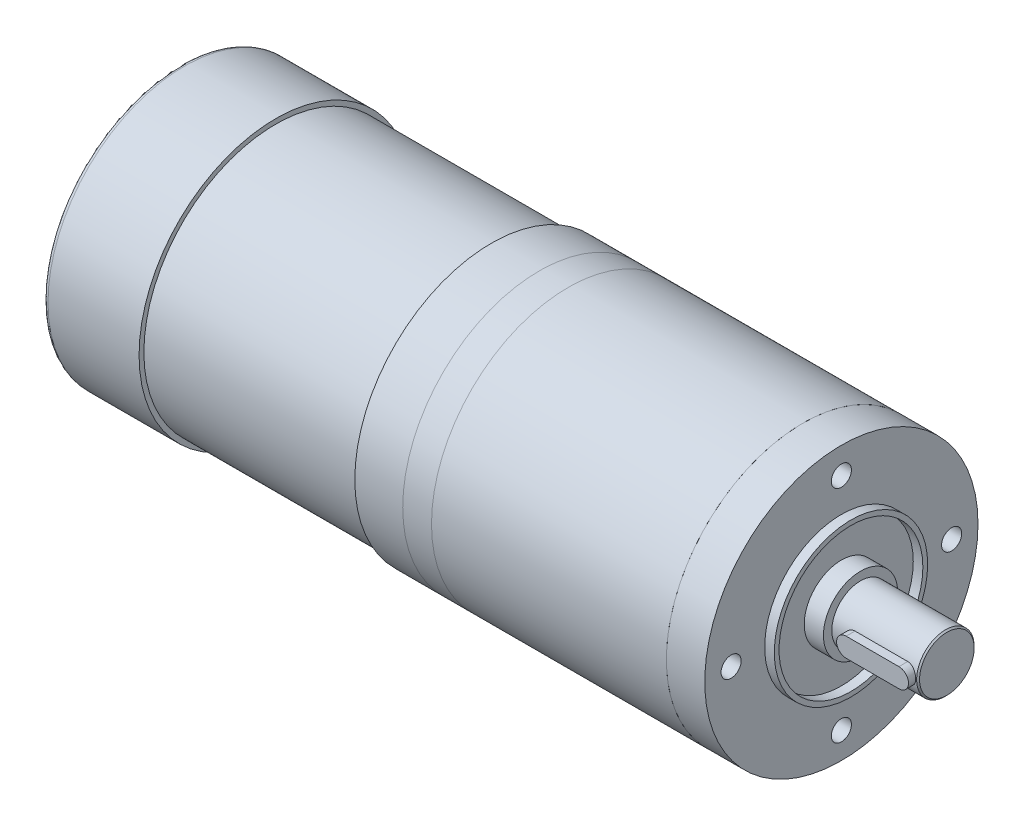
ISO-10303-21;
HEADER;
FILE_DESCRIPTION(('STEP AP214'),'2;1');
FILE_NAME('part.step','',(''),(''),'','','');
FILE_SCHEMA(('AUTOMOTIVE_DESIGN { 1 0 10303 214 1 1 1 1 }'));
ENDSEC;
DATA;
#1=APPLICATION_CONTEXT('core data for automotive mechanical design processes');
#2=APPLICATION_PROTOCOL_DEFINITION('international standard','automotive_design',2000,#1);
#3=PRODUCT_CONTEXT('',#1,'mechanical');
#4=PRODUCT('Part','Part','',(#3));
#5=PRODUCT_RELATED_PRODUCT_CATEGORY('part','',(#4));
#6=PRODUCT_DEFINITION_FORMATION('','',#4);
#7=PRODUCT_DEFINITION_CONTEXT('part definition',#1,'design');
#8=PRODUCT_DEFINITION('design','',#6,#7);
#9=PRODUCT_DEFINITION_SHAPE('','',#8);
#10=(LENGTH_UNIT() NAMED_UNIT(*) SI_UNIT(.MILLI.,.METRE.));
#11=(NAMED_UNIT(*) PLANE_ANGLE_UNIT() SI_UNIT($,.RADIAN.));
#12=(NAMED_UNIT(*) SI_UNIT($,.STERADIAN.) SOLID_ANGLE_UNIT());
#13=UNCERTAINTY_MEASURE_WITH_UNIT(LENGTH_MEASURE(1.E-05),#10,'distance_accuracy_value','');
#14=(GEOMETRIC_REPRESENTATION_CONTEXT(3) GLOBAL_UNCERTAINTY_ASSIGNED_CONTEXT((#13)) GLOBAL_UNIT_ASSIGNED_CONTEXT((#10,
#11,#12)) REPRESENTATION_CONTEXT('',''));
#15=CARTESIAN_POINT('',(0.,0.,0.));
#16=DIRECTION('',(0.,0.,1.));
#17=DIRECTION('',(1.,0.,0.));
#18=AXIS2_PLACEMENT_3D('',#15,#16,#17);
#19=CARTESIAN_POINT('',(8.5,0.,7.5));
#20=DIRECTION('',(0.,0.,-1.));
#21=DIRECTION('',(-1.,0.,0.));
#22=AXIS2_PLACEMENT_3D('',#19,#20,#21);
#23=CYLINDRICAL_SURFACE('',#22,2.);
#24=CARTESIAN_POINT('',(8.5,0.,3.5));
#25=DIRECTION('',(0.,0.,1.));
#26=DIRECTION('',(1.,0.,0.));
#27=AXIS2_PLACEMENT_3D('',#24,#25,#26);
#28=CIRCLE('',#27,2.);
#29=CARTESIAN_POINT('',(8.5,2.,3.5));
#30=VERTEX_POINT('',#29);
#31=CARTESIAN_POINT('',(8.5,-2.,3.5));
#32=VERTEX_POINT('',#31);
#33=EDGE_CURVE('E109',#30,#32,#28,.T.);
#34=ORIENTED_EDGE('',*,*,#33,.T.);
#35=DIRECTION('',(0.,0.,-1.));
#36=VECTOR('',#35,1.);
#37=CARTESIAN_POINT('',(8.5,-2.,7.5));
#38=LINE('',#37,#36);
#39=CARTESIAN_POINT('',(8.5,-2.,7.5));
#40=VERTEX_POINT('',#39);
#41=EDGE_CURVE('E12',#40,#32,#38,.T.);
#42=ORIENTED_EDGE('',*,*,#41,.F.);
#43=CARTESIAN_POINT('',(8.5,0.,7.5));
#44=DIRECTION('',(0.,0.,1.));
#45=DIRECTION('',(1.,0.,0.));
#46=AXIS2_PLACEMENT_3D('',#43,#44,#45);
#47=CIRCLE('',#46,2.);
#48=CARTESIAN_POINT('',(8.5,2.,7.5));
#49=VERTEX_POINT('',#48);
#50=EDGE_CURVE('E97',#49,#40,#47,.T.);
#51=ORIENTED_EDGE('',*,*,#50,.F.);
#52=DIRECTION('',(0.,0.,-1.));
#53=VECTOR('',#52,1.);
#54=CARTESIAN_POINT('',(8.5,2.,7.5));
#55=LINE('',#54,#53);
#56=EDGE_CURVE('E105',#49,#30,#55,.T.);
#57=ORIENTED_EDGE('',*,*,#56,.T.);
#58=EDGE_LOOP('',(#34,#42,#51,#57));
#59=FACE_BOUND('',#58,.T.);
#60=ADVANCED_FACE('F46',(#59),#23,.T.);
#61=CARTESIAN_POINT('',(19.5,-2.,7.5));
#62=DIRECTION('',(0.,1.,0.));
#63=DIRECTION('',(-1.,0.,0.));
#64=AXIS2_PLACEMENT_3D('',#61,#62,#63);
#65=PLANE('',#64);
#66=DIRECTION('',(1.,0.,0.));
#67=VECTOR('',#66,1.);
#68=CARTESIAN_POINT('',(19.5,-2.,3.5));
#69=LINE('',#68,#67);
#70=CARTESIAN_POINT('',(19.5,-2.,3.5));
#71=VERTEX_POINT('',#70);
#72=EDGE_CURVE('E101',#32,#71,#69,.T.);
#73=ORIENTED_EDGE('',*,*,#72,.T.);
#74=DIRECTION('',(0.,0.,-1.));
#75=VECTOR('',#74,1.);
#76=CARTESIAN_POINT('',(19.5,-2.,7.5));
#77=LINE('',#76,#75);
#78=CARTESIAN_POINT('',(19.5,-2.,7.5));
#79=VERTEX_POINT('',#78);
#80=EDGE_CURVE('E54',#79,#71,#77,.T.);
#81=ORIENTED_EDGE('',*,*,#80,.F.);
#82=DIRECTION('',(1.,0.,0.));
#83=VECTOR('',#82,1.);
#84=CARTESIAN_POINT('',(19.5,-2.,7.5));
#85=LINE('',#84,#83);
#86=EDGE_CURVE('E92',#40,#79,#85,.T.);
#87=ORIENTED_EDGE('',*,*,#86,.F.);
#88=ORIENTED_EDGE('',*,*,#41,.T.);
#89=EDGE_LOOP('',(#73,#81,#87,#88));
#90=FACE_BOUND('',#89,.T.);
#91=ADVANCED_FACE('F100',(#90),#65,.F.);
#92=CARTESIAN_POINT('',(19.5,0.,7.5));
#93=DIRECTION('',(0.,0.,-1.));
#94=DIRECTION('',(-1.,0.,0.));
#95=AXIS2_PLACEMENT_3D('',#92,#93,#94);
#96=CYLINDRICAL_SURFACE('',#95,2.);
#97=CARTESIAN_POINT('',(19.5,0.,3.5));
#98=DIRECTION('',(0.,0.,1.));
#99=DIRECTION('',(1.,0.,0.));
#100=AXIS2_PLACEMENT_3D('',#97,#98,#99);
#101=CIRCLE('',#100,2.);
#102=CARTESIAN_POINT('',(19.5,2.,3.5));
#103=VERTEX_POINT('',#102);
#104=EDGE_CURVE('E79',#71,#103,#101,.T.);
#105=ORIENTED_EDGE('',*,*,#104,.T.);
#106=DIRECTION('',(0.,0.,-1.));
#107=VECTOR('',#106,1.);
#108=CARTESIAN_POINT('',(19.5,2.,7.5));
#109=LINE('',#108,#107);
#110=CARTESIAN_POINT('',(19.5,2.,7.5));
#111=VERTEX_POINT('',#110);
#112=EDGE_CURVE('E102',#111,#103,#109,.T.);
#113=ORIENTED_EDGE('',*,*,#112,.F.);
#114=CARTESIAN_POINT('',(19.5,0.,7.5));
#115=DIRECTION('',(0.,0.,1.));
#116=DIRECTION('',(1.,0.,0.));
#117=AXIS2_PLACEMENT_3D('',#114,#115,#116);
#118=CIRCLE('',#117,2.);
#119=EDGE_CURVE('E95',#79,#111,#118,.T.);
#120=ORIENTED_EDGE('',*,*,#119,.F.);
#121=ORIENTED_EDGE('',*,*,#80,.T.);
#122=EDGE_LOOP('',(#105,#113,#120,#121));
#123=FACE_BOUND('',#122,.T.);
#124=ADVANCED_FACE('F103',(#123),#96,.T.);
#125=CARTESIAN_POINT('',(8.5,2.,7.5));
#126=DIRECTION('',(0.,-1.,0.));
#127=DIRECTION('',(1.,0.,0.));
#128=AXIS2_PLACEMENT_3D('',#125,#126,#127);
#129=PLANE('',#128);
#130=DIRECTION('',(-1.,0.,0.));
#131=VECTOR('',#130,1.);
#132=CARTESIAN_POINT('',(8.5,2.,3.5));
#133=LINE('',#132,#131);
#134=EDGE_CURVE('E85',#103,#30,#133,.T.);
#135=ORIENTED_EDGE('',*,*,#134,.T.);
#136=ORIENTED_EDGE('',*,*,#56,.F.);
#137=DIRECTION('',(-1.,0.,0.));
#138=VECTOR('',#137,1.);
#139=CARTESIAN_POINT('',(8.5,2.,7.5));
#140=LINE('',#139,#138);
#141=EDGE_CURVE('E62',#111,#49,#140,.T.);
#142=ORIENTED_EDGE('',*,*,#141,.F.);
#143=ORIENTED_EDGE('',*,*,#112,.T.);
#144=EDGE_LOOP('',(#135,#136,#142,#143));
#145=FACE_BOUND('',#144,.T.);
#146=ADVANCED_FACE('F116',(#145),#129,.F.);
#147=CARTESIAN_POINT('',(8.5,0.,7.5));
#148=DIRECTION('',(0.,0.,1.));
#149=DIRECTION('',(1.,0.,0.));
#150=AXIS2_PLACEMENT_3D('',#147,#148,#149);
#151=PLANE('',#150);
#152=ORIENTED_EDGE('',*,*,#50,.T.);
#153=ORIENTED_EDGE('',*,*,#86,.T.);
#154=ORIENTED_EDGE('',*,*,#119,.T.);
#155=ORIENTED_EDGE('',*,*,#141,.T.);
#156=EDGE_LOOP('',(#152,#153,#154,#155));
#157=FACE_BOUND('',#156,.T.);
#158=ADVANCED_FACE('F93',(#157),#151,.T.);
#159=CARTESIAN_POINT('',(8.5,0.,3.5));
#160=DIRECTION('',(0.,0.,1.));
#161=DIRECTION('',(1.,0.,0.));
#162=AXIS2_PLACEMENT_3D('',#159,#160,#161);
#163=PLANE('',#162);
#164=ORIENTED_EDGE('',*,*,#33,.F.);
#165=ORIENTED_EDGE('',*,*,#134,.F.);
#166=ORIENTED_EDGE('',*,*,#104,.F.);
#167=ORIENTED_EDGE('',*,*,#72,.F.);
#168=EDGE_LOOP('',(#164,#165,#166,#167));
#169=FACE_BOUND('',#168,.T.);
#170=ADVANCED_FACE('F119',(#169),#163,.F.);
#171=CLOSED_SHELL('',(#60,#91,#124,#146,#158,#170));
#172=MANIFOLD_SOLID_BREP('B2',#171);
#173=CARTESIAN_POINT('',(-73.,0.,0.));
#174=DIRECTION('',(-1.,0.,0.));
#175=DIRECTION('',(0.,0.,1.));
#176=AXIS2_PLACEMENT_3D('',#173,#174,#175);
#177=PLANE('',#176);
#178=CARTESIAN_POINT('',(-73.,0.,0.));
#179=DIRECTION('',(-1.,0.,0.));
#180=DIRECTION('',(0.,0.,1.));
#181=AXIS2_PLACEMENT_3D('',#178,#179,#180);
#182=CIRCLE('',#181,28.5);
#183=CARTESIAN_POINT('',(-73.,0.,28.5));
#184=VERTEX_POINT('',#183);
#185=EDGE_CURVE('E189',#184,#184,#182,.T.);
#186=ORIENTED_EDGE('',*,*,#185,.T.);
#187=EDGE_LOOP('',(#186));
#188=FACE_BOUND('',#187,.T.);
#189=CARTESIAN_POINT('',(-73.,0.,0.));
#190=DIRECTION('',(-1.,0.,0.));
#191=DIRECTION('',(0.,0.,1.));
#192=AXIS2_PLACEMENT_3D('',#189,#190,#191);
#193=CIRCLE('',#192,27.5);
#194=CARTESIAN_POINT('',(-73.,0.,-27.5));
#195=VERTEX_POINT('',#194);
#196=EDGE_CURVE('E199',#195,#195,#193,.T.);
#197=ORIENTED_EDGE('',*,*,#196,.F.);
#198=EDGE_LOOP('',(#197));
#199=FACE_BOUND('',#198,.T.);
#200=ADVANCED_FACE('F178',(#188,#199),#177,.T.);
#201=CARTESIAN_POINT('',(-73.,0.,0.));
#202=DIRECTION('',(1.,0.,0.));
#203=DIRECTION('',(0.,0.,-1.));
#204=AXIS2_PLACEMENT_3D('',#201,#202,#203);
#205=CYLINDRICAL_SURFACE('',#204,28.5);
#206=ORIENTED_EDGE('',*,*,#185,.F.);
#207=EDGE_LOOP('',(#206));
#208=FACE_BOUND('',#207,.T.);
#209=CARTESIAN_POINT('',(-63.,0.,0.));
#210=DIRECTION('',(-1.,0.,0.));
#211=DIRECTION('',(0.,0.,1.));
#212=AXIS2_PLACEMENT_3D('',#209,#210,#211);
#213=CIRCLE('',#212,28.5);
#214=CARTESIAN_POINT('',(-63.,0.,28.5));
#215=VERTEX_POINT('',#214);
#216=EDGE_CURVE('E193',#215,#215,#213,.T.);
#217=ORIENTED_EDGE('',*,*,#216,.T.);
#218=EDGE_LOOP('',(#217));
#219=FACE_BOUND('',#218,.T.);
#220=ADVANCED_FACE('F224',(#208,#219),#205,.T.);
#221=CARTESIAN_POINT('',(-63.,0.,0.));
#222=DIRECTION('',(-1.,0.,0.));
#223=DIRECTION('',(0.,0.,1.));
#224=AXIS2_PLACEMENT_3D('',#221,#222,#223);
#225=PLANE('',#224);
#226=ORIENTED_EDGE('',*,*,#216,.F.);
#227=EDGE_LOOP('',(#226));
#228=FACE_BOUND('',#227,.T.);
#229=ADVANCED_FACE('F219',(#228),#225,.F.);
#230=CARTESIAN_POINT('',(-118.,0.,0.));
#231=DIRECTION('',(1.,0.,0.));
#232=DIRECTION('',(0.,0.,-1.));
#233=AXIS2_PLACEMENT_3D('',#230,#231,#232);
#234=CYLINDRICAL_SURFACE('',#233,27.5);
#235=CARTESIAN_POINT('',(-118.,0.,0.));
#236=DIRECTION('',(-1.,0.,0.));
#237=DIRECTION('',(0.,0.,1.));
#238=AXIS2_PLACEMENT_3D('',#235,#236,#237);
#239=CIRCLE('',#238,27.5);
#240=CARTESIAN_POINT('',(-118.,0.,-27.5));
#241=VERTEX_POINT('',#240);
#242=EDGE_CURVE('E197',#241,#241,#239,.T.);
#243=CARTESIAN_POINT('',(-118.,0.,-27.5));
#244=CARTESIAN_POINT('',(-117.53125,0.,-27.5));
#245=CARTESIAN_POINT('',(-117.0625,0.,-27.5));
#246=CARTESIAN_POINT('',(-116.125,0.,-27.5));
#247=CARTESIAN_POINT('',(-115.65625,0.,-27.5));
#248=CARTESIAN_POINT('',(-114.71875,0.,-27.5));
#249=CARTESIAN_POINT('',(-114.25,0.,-27.5));
#250=CARTESIAN_POINT('',(-113.3125,0.,-27.5));
#251=CARTESIAN_POINT('',(-112.84375,0.,-27.5));
#252=CARTESIAN_POINT('',(-111.90625,0.,-27.5));
#253=CARTESIAN_POINT('',(-111.4375,0.,-27.5));
#254=CARTESIAN_POINT('',(-110.5,0.,-27.5));
#255=CARTESIAN_POINT('',(-110.03125,0.,-27.5));
#256=CARTESIAN_POINT('',(-109.09375,0.,-27.5));
#257=CARTESIAN_POINT('',(-108.625,0.,-27.5));
#258=CARTESIAN_POINT('',(-107.6875,0.,-27.5));
#259=CARTESIAN_POINT('',(-107.21875,0.,-27.5));
#260=CARTESIAN_POINT('',(-106.28125,0.,-27.5));
#261=CARTESIAN_POINT('',(-105.8125,0.,-27.5));
#262=CARTESIAN_POINT('',(-104.875,0.,-27.5));
#263=CARTESIAN_POINT('',(-104.40625,0.,-27.5));
#264=CARTESIAN_POINT('',(-103.46875,0.,-27.5));
#265=CARTESIAN_POINT('',(-103.,0.,-27.5));
#266=CARTESIAN_POINT('',(-102.0625,0.,-27.5));
#267=CARTESIAN_POINT('',(-101.59375,0.,-27.5));
#268=CARTESIAN_POINT('',(-100.65625,0.,-27.5));
#269=CARTESIAN_POINT('',(-100.1875,0.,-27.5));
#270=CARTESIAN_POINT('',(-99.25,0.,-27.5));
#271=CARTESIAN_POINT('',(-98.78125,0.,-27.5));
#272=CARTESIAN_POINT('',(-97.84375,0.,-27.5));
#273=CARTESIAN_POINT('',(-97.375,0.,-27.5));
#274=CARTESIAN_POINT('',(-96.4375,0.,-27.5));
#275=CARTESIAN_POINT('',(-95.96875,0.,-27.5));
#276=CARTESIAN_POINT('',(-95.03125,0.,-27.5));
#277=CARTESIAN_POINT('',(-94.5625,0.,-27.5));
#278=CARTESIAN_POINT('',(-93.625,0.,-27.5));
#279=CARTESIAN_POINT('',(-93.15625,0.,-27.5));
#280=CARTESIAN_POINT('',(-92.21875,0.,-27.5));
#281=CARTESIAN_POINT('',(-91.75,0.,-27.5));
#282=CARTESIAN_POINT('',(-90.8125,0.,-27.5));
#283=CARTESIAN_POINT('',(-90.34375,0.,-27.5));
#284=CARTESIAN_POINT('',(-89.40625,0.,-27.5));
#285=CARTESIAN_POINT('',(-88.9375,0.,-27.5));
#286=CARTESIAN_POINT('',(-88.,0.,-27.5));
#287=CARTESIAN_POINT('',(-87.53125,0.,-27.5));
#288=CARTESIAN_POINT('',(-86.59375,0.,-27.5));
#289=CARTESIAN_POINT('',(-86.125,0.,-27.5));
#290=CARTESIAN_POINT('',(-85.1875,0.,-27.5));
#291=CARTESIAN_POINT('',(-84.71875,0.,-27.5));
#292=CARTESIAN_POINT('',(-83.78125,0.,-27.5));
#293=CARTESIAN_POINT('',(-83.3125,0.,-27.5));
#294=CARTESIAN_POINT('',(-82.375,0.,-27.5));
#295=CARTESIAN_POINT('',(-81.90625,0.,-27.5));
#296=CARTESIAN_POINT('',(-80.96875,0.,-27.5));
#297=CARTESIAN_POINT('',(-80.5,0.,-27.5));
#298=CARTESIAN_POINT('',(-79.5625,0.,-27.5));
#299=CARTESIAN_POINT('',(-79.09375,0.,-27.5));
#300=CARTESIAN_POINT('',(-78.15625,0.,-27.5));
#301=CARTESIAN_POINT('',(-77.6875,0.,-27.5));
#302=CARTESIAN_POINT('',(-76.75,0.,-27.5));
#303=CARTESIAN_POINT('',(-76.28125,0.,-27.5));
#304=CARTESIAN_POINT('',(-75.34375,0.,-27.5));
#305=CARTESIAN_POINT('',(-74.875,0.,-27.5));
#306=CARTESIAN_POINT('',(-73.9375,0.,-27.5));
#307=CARTESIAN_POINT('',(-73.46875,0.,-27.5));
#308=CARTESIAN_POINT('',(-73.,0.,-27.5));
#309=B_SPLINE_CURVE_WITH_KNOTS('',3,(#243,#244,#245,#246,#247,#248,#249,#250,#251,#252,#253,
#254,#255,#256,#257,#258,#259,#260,#261,#262,#263,#264,#265,#266,#267,#268,#269,#270,#271,#272,
#273,#274,#275,#276,#277,#278,#279,#280,#281,#282,#283,#284,#285,#286,#287,#288,#289,#290,#291,
#292,#293,#294,#295,#296,#297,#298,#299,#300,#301,#302,#303,#304,#305,#306,#307,#308),
.UNSPECIFIED.,.F.,.F.,(4,2,2,2,2,2,2,2,2,2,2,2,2,2,2,2,2,2,2,2,2,2,2,2,2,2,2,2,2,2,2,2,4),(0.,
1.40625,2.8125,4.21874999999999,5.62499999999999,7.03124999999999,8.43749999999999,9.84375,
11.25,12.65625,14.0625,15.46875,16.875,18.28125,19.6875,21.09375,22.5,23.90625,25.3125,26.71875,
28.125,29.53125,30.9375,32.34375,33.75,35.15625,36.5625,37.96875,39.375,40.78125,42.1875,
43.59375,45.),.UNSPECIFIED.);
#310=EDGE_CURVE('BSEAM213',#241,#195,#309,.T.);
#311=ORIENTED_EDGE('',*,*,#242,.F.);
#312=ORIENTED_EDGE('',*,*,#196,.T.);
#313=ORIENTED_EDGE('',*,*,#310,.T.);
#314=ORIENTED_EDGE('',*,*,#310,.F.);
#315=EDGE_LOOP('',(#311,#313,#312,#314));
#316=FACE_BOUND('',#315,.T.);
#317=ADVANCED_FACE('F213',(#316),#234,.T.);
#318=CARTESIAN_POINT('',(-118.,0.,0.));
#319=DIRECTION('',(-1.,0.,0.));
#320=DIRECTION('',(0.,0.,1.));
#321=AXIS2_PLACEMENT_3D('',#318,#319,#320);
#322=PLANE('',#321);
#323=CARTESIAN_POINT('',(-118.,0.,0.));
#324=DIRECTION('',(-1.,0.,0.));
#325=DIRECTION('',(0.,0.,1.));
#326=AXIS2_PLACEMENT_3D('',#323,#324,#325);
#327=CIRCLE('',#326,28.5);
#328=CARTESIAN_POINT('',(-118.,0.,28.5));
#329=VERTEX_POINT('',#328);
#330=EDGE_CURVE('E202',#329,#329,#327,.T.);
#331=ORIENTED_EDGE('',*,*,#330,.F.);
#332=EDGE_LOOP('',(#331));
#333=FACE_BOUND('',#332,.T.);
#334=ORIENTED_EDGE('',*,*,#242,.T.);
#335=EDGE_LOOP('',(#334));
#336=FACE_BOUND('',#335,.T.);
#337=ADVANCED_FACE('F210',(#333,#336),#322,.F.);
#338=CARTESIAN_POINT('',(-138.,0.,0.));
#339=DIRECTION('',(1.,0.,0.));
#340=DIRECTION('',(0.,0.,-1.));
#341=AXIS2_PLACEMENT_3D('',#338,#339,#340);
#342=CYLINDRICAL_SURFACE('',#341,28.5);
#343=CARTESIAN_POINT('',(-137.,0.,0.));
#344=DIRECTION('',(-1.,0.,0.));
#345=DIRECTION('',(0.,0.,1.));
#346=AXIS2_PLACEMENT_3D('',#343,#344,#345);
#347=CIRCLE('',#346,28.5);
#348=CARTESIAN_POINT('',(-137.,0.,28.5));
#349=VERTEX_POINT('',#348);
#350=EDGE_CURVE('E45',#349,#349,#347,.F.);
#351=ORIENTED_EDGE('',*,*,#350,.T.);
#352=EDGE_LOOP('',(#351));
#353=FACE_BOUND('',#352,.T.);
#354=ORIENTED_EDGE('',*,*,#330,.T.);
#355=EDGE_LOOP('',(#354));
#356=FACE_BOUND('',#355,.T.);
#357=ADVANCED_FACE('F208',(#353,#356),#342,.T.);
#358=CARTESIAN_POINT('',(-138.,0.,0.));
#359=DIRECTION('',(-1.,0.,0.));
#360=DIRECTION('',(0.,0.,1.));
#361=AXIS2_PLACEMENT_3D('',#358,#359,#360);
#362=PLANE('',#361);
#363=CARTESIAN_POINT('',(-138.,0.,0.));
#364=DIRECTION('',(-1.,0.,0.));
#365=DIRECTION('',(0.,0.,1.));
#366=AXIS2_PLACEMENT_3D('',#363,#364,#365);
#367=CIRCLE('',#366,27.5);
#368=CARTESIAN_POINT('',(-138.,0.,27.5));
#369=VERTEX_POINT('',#368);
#370=EDGE_CURVE('E185',#369,#369,#367,.T.);
#371=ORIENTED_EDGE('',*,*,#370,.T.);
#372=EDGE_LOOP('',(#371));
#373=FACE_BOUND('',#372,.T.);
#374=ADVANCED_FACE('F255',(#373),#362,.T.);
#375=CARTESIAN_POINT('',(-137.,0.,0.));
#376=DIRECTION('',(-1.,0.,0.));
#377=DIRECTION('',(0.,0.,1.));
#378=AXIS2_PLACEMENT_3D('',#375,#376,#377);
#379=TOROIDAL_SURFACE('',#378,27.5,1.);
#380=ORIENTED_EDGE('',*,*,#350,.F.);
#381=EDGE_LOOP('',(#380));
#382=FACE_BOUND('',#381,.T.);
#383=ORIENTED_EDGE('',*,*,#370,.F.);
#384=EDGE_LOOP('',(#383));
#385=FACE_BOUND('',#384,.T.);
#386=ADVANCED_FACE('F180',(#382,#385),#379,.T.);
#387=CLOSED_SHELL('',(#200,#220,#229,#317,#337,#357,#374,#386));
#388=MANIFOLD_SOLID_BREP('B6',#387);
#389=CARTESIAN_POINT('',(-63.,0.,0.));
#390=DIRECTION('',(1.,0.,0.));
#391=DIRECTION('',(0.,0.,-1.));
#392=AXIS2_PLACEMENT_3D('',#389,#390,#391);
#393=CYLINDRICAL_SURFACE('',#392,28.5);
#394=CARTESIAN_POINT('',(-63.,0.,0.));
#395=DIRECTION('',(-1.,0.,0.));
#396=DIRECTION('',(0.,0.,1.));
#397=AXIS2_PLACEMENT_3D('',#394,#395,#396);
#398=CIRCLE('',#397,28.5);
#399=CARTESIAN_POINT('',(-63.,0.,28.5));
#400=VERTEX_POINT('',#399);
#401=EDGE_CURVE('E177',#400,#400,#398,.T.);
#402=ORIENTED_EDGE('',*,*,#401,.F.);
#403=EDGE_LOOP('',(#402));
#404=FACE_BOUND('',#403,.T.);
#405=CARTESIAN_POINT('',(-57.,0.,0.));
#406=DIRECTION('',(-1.,0.,0.));
#407=DIRECTION('',(0.,0.,1.));
#408=AXIS2_PLACEMENT_3D('',#405,#406,#407);
#409=CIRCLE('',#408,28.5);
#410=CARTESIAN_POINT('',(-57.,0.,28.5));
#411=VERTEX_POINT('',#410);
#412=EDGE_CURVE('E307',#411,#411,#409,.T.);
#413=ORIENTED_EDGE('',*,*,#412,.T.);
#414=EDGE_LOOP('',(#413));
#415=FACE_BOUND('',#414,.T.);
#416=ADVANCED_FACE('F304',(#404,#415),#393,.T.);
#417=CARTESIAN_POINT('',(-63.,0.,0.));
#418=DIRECTION('',(-1.,0.,0.));
#419=DIRECTION('',(0.,0.,1.));
#420=AXIS2_PLACEMENT_3D('',#417,#418,#419);
#421=PLANE('',#420);
#422=ORIENTED_EDGE('',*,*,#401,.T.);
#423=EDGE_LOOP('',(#422));
#424=FACE_BOUND('',#423,.T.);
#425=ADVANCED_FACE('F319',(#424),#421,.T.);
#426=CARTESIAN_POINT('',(-57.,0.,0.));
#427=DIRECTION('',(-1.,0.,0.));
#428=DIRECTION('',(0.,0.,1.));
#429=AXIS2_PLACEMENT_3D('',#426,#427,#428);
#430=PLANE('',#429);
#431=ORIENTED_EDGE('',*,*,#412,.F.);
#432=EDGE_LOOP('',(#431));
#433=FACE_BOUND('',#432,.T.);
#434=ADVANCED_FACE('F317',(#433),#430,.F.);
#435=CLOSED_SHELL('',(#416,#425,#434));
#436=MANIFOLD_SOLID_BREP('B40',#435);
#437=CARTESIAN_POINT('',(-57.,0.,0.));
#438=DIRECTION('',(1.,0.,0.));
#439=DIRECTION('',(0.,0.,-1.));
#440=AXIS2_PLACEMENT_3D('',#437,#438,#439);
#441=CYLINDRICAL_SURFACE('',#440,28.5);
#442=CARTESIAN_POINT('',(-57.,0.,0.));
#443=DIRECTION('',(-1.,0.,0.));
#444=DIRECTION('',(0.,0.,1.));
#445=AXIS2_PLACEMENT_3D('',#442,#443,#444);
#446=CIRCLE('',#445,28.5);
#447=CARTESIAN_POINT('',(-57.,0.,28.5));
#448=VERTEX_POINT('',#447);
#449=EDGE_CURVE('E302',#448,#448,#446,.T.);
#450=ORIENTED_EDGE('',*,*,#449,.F.);
#451=EDGE_LOOP('',(#450));
#452=FACE_BOUND('',#451,.T.);
#453=CARTESIAN_POINT('',(-8.,0.,0.));
#454=DIRECTION('',(-1.,0.,0.));
#455=DIRECTION('',(0.,0.,1.));
#456=AXIS2_PLACEMENT_3D('',#453,#454,#455);
#457=CIRCLE('',#456,28.5);
#458=CARTESIAN_POINT('',(-8.,0.,28.5));
#459=VERTEX_POINT('',#458);
#460=EDGE_CURVE('E362',#459,#459,#457,.T.);
#461=ORIENTED_EDGE('',*,*,#460,.T.);
#462=EDGE_LOOP('',(#461));
#463=FACE_BOUND('',#462,.T.);
#464=ADVANCED_FACE('F354',(#452,#463),#441,.T.);
#465=CARTESIAN_POINT('',(-57.,0.,0.));
#466=DIRECTION('',(-1.,0.,0.));
#467=DIRECTION('',(0.,0.,1.));
#468=AXIS2_PLACEMENT_3D('',#465,#466,#467);
#469=PLANE('',#468);
#470=ORIENTED_EDGE('',*,*,#449,.T.);
#471=EDGE_LOOP('',(#470));
#472=FACE_BOUND('',#471,.T.);
#473=ADVANCED_FACE('F427',(#472),#469,.T.);
#474=CARTESIAN_POINT('',(-8.,0.,0.));
#475=DIRECTION('',(-1.,0.,0.));
#476=DIRECTION('',(0.,0.,1.));
#477=AXIS2_PLACEMENT_3D('',#474,#475,#476);
#478=PLANE('',#477);
#479=CARTESIAN_POINT('',(-8.,23.,0.));
#480=DIRECTION('',(-1.,0.,0.));
#481=DIRECTION('',(0.,0.,1.));
#482=AXIS2_PLACEMENT_3D('',#479,#480,#481);
#483=CIRCLE('',#482,2.1);
#484=CARTESIAN_POINT('',(-8.,23.,2.1));
#485=VERTEX_POINT('',#484);
#486=EDGE_CURVE('E357',#485,#485,#483,.T.);
#487=ORIENTED_EDGE('',*,*,#486,.T.);
#488=EDGE_LOOP('',(#487));
#489=FACE_BOUND('',#488,.T.);
#490=CARTESIAN_POINT('',(-8.,0.,-23.));
#491=DIRECTION('',(-1.,0.,0.));
#492=DIRECTION('',(0.,0.,1.));
#493=AXIS2_PLACEMENT_3D('',#490,#491,#492);
#494=CIRCLE('',#493,2.1);
#495=CARTESIAN_POINT('',(-8.,0.,-20.9));
#496=VERTEX_POINT('',#495);
#497=EDGE_CURVE('E391',#496,#496,#494,.T.);
#498=ORIENTED_EDGE('',*,*,#497,.T.);
#499=EDGE_LOOP('',(#498));
#500=FACE_BOUND('',#499,.T.);
#501=CARTESIAN_POINT('',(-8.,-23.,0.));
#502=DIRECTION('',(-1.,0.,0.));
#503=DIRECTION('',(0.,0.,1.));
#504=AXIS2_PLACEMENT_3D('',#501,#502,#503);
#505=CIRCLE('',#504,2.1);
#506=CARTESIAN_POINT('',(-8.,-23.,2.1));
#507=VERTEX_POINT('',#506);
#508=EDGE_CURVE('E395',#507,#507,#505,.T.);
#509=ORIENTED_EDGE('',*,*,#508,.T.);
#510=EDGE_LOOP('',(#509));
#511=FACE_BOUND('',#510,.T.);
#512=CARTESIAN_POINT('',(-8.,0.,23.));
#513=DIRECTION('',(-1.,0.,0.));
#514=DIRECTION('',(0.,0.,1.));
#515=AXIS2_PLACEMENT_3D('',#512,#513,#514);
#516=CIRCLE('',#515,2.1);
#517=CARTESIAN_POINT('',(-8.,0.,25.1));
#518=VERTEX_POINT('',#517);
#519=EDGE_CURVE('E398',#518,#518,#516,.T.);
#520=ORIENTED_EDGE('',*,*,#519,.T.);
#521=EDGE_LOOP('',(#520));
#522=FACE_BOUND('',#521,.T.);
#523=ORIENTED_EDGE('',*,*,#460,.F.);
#524=EDGE_LOOP('',(#523));
#525=FACE_BOUND('',#524,.T.);
#526=ADVANCED_FACE('F408',(#489,#500,#511,#522,#525),#478,.F.);
#527=CARTESIAN_POINT('',(0.,0.,23.));
#528=DIRECTION('',(1.,0.,0.));
#529=DIRECTION('',(0.,0.,-1.));
#530=AXIS2_PLACEMENT_3D('',#527,#528,#529);
#531=CYLINDRICAL_SURFACE('',#530,2.1);
#532=CARTESIAN_POINT('',(-14.,0.,23.));
#533=DIRECTION('',(1.,0.,0.));
#534=DIRECTION('',(0.,0.,-1.));
#535=AXIS2_PLACEMENT_3D('',#532,#533,#534);
#536=CIRCLE('',#535,2.1);
#537=CARTESIAN_POINT('',(-14.,0.,20.9));
#538=VERTEX_POINT('',#537);
#539=EDGE_CURVE('E396',#538,#538,#536,.T.);
#540=ORIENTED_EDGE('',*,*,#539,.F.);
#541=EDGE_LOOP('',(#540));
#542=FACE_BOUND('',#541,.T.);
#543=ORIENTED_EDGE('',*,*,#519,.F.);
#544=EDGE_LOOP('',(#543));
#545=FACE_BOUND('',#544,.T.);
#546=ADVANCED_FACE('F439',(#542,#545),#531,.F.);
#547=CARTESIAN_POINT('',(-14.,0.,23.));
#548=DIRECTION('',(1.,0.,0.));
#549=DIRECTION('',(0.,0.,-1.));
#550=AXIS2_PLACEMENT_3D('',#547,#548,#549);
#551=CONICAL_SURFACE('',#550,2.1,1.02974425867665);
#552=CARTESIAN_POINT('',(-15.2618072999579,0.,23.));
#553=VERTEX_POINT('',#552);
#554=VERTEX_LOOP('',#553);
#555=FACE_BOUND('',#554,.T.);
#556=ORIENTED_EDGE('',*,*,#539,.T.);
#557=EDGE_LOOP('',(#556));
#558=FACE_BOUND('',#557,.T.);
#559=ADVANCED_FACE('F444',(#555,#558),#551,.F.);
#560=CARTESIAN_POINT('',(0.,-23.,0.));
#561=DIRECTION('',(1.,0.,0.));
#562=DIRECTION('',(0.,0.,-1.));
#563=AXIS2_PLACEMENT_3D('',#560,#561,#562);
#564=CYLINDRICAL_SURFACE('',#563,2.1);
#565=CARTESIAN_POINT('',(-14.,-23.,0.));
#566=DIRECTION('',(1.,0.,0.));
#567=DIRECTION('',(0.,0.,-1.));
#568=AXIS2_PLACEMENT_3D('',#565,#566,#567);
#569=CIRCLE('',#568,2.1);
#570=CARTESIAN_POINT('',(-14.,-23.,-2.1));
#571=VERTEX_POINT('',#570);
#572=EDGE_CURVE('E392',#571,#571,#569,.T.);
#573=ORIENTED_EDGE('',*,*,#572,.F.);
#574=EDGE_LOOP('',(#573));
#575=FACE_BOUND('',#574,.T.);
#576=ORIENTED_EDGE('',*,*,#508,.F.);
#577=EDGE_LOOP('',(#576));
#578=FACE_BOUND('',#577,.T.);
#579=ADVANCED_FACE('F423',(#575,#578),#564,.F.);
#580=CARTESIAN_POINT('',(-14.,-23.,0.));
#581=DIRECTION('',(1.,0.,0.));
#582=DIRECTION('',(0.,0.,-1.));
#583=AXIS2_PLACEMENT_3D('',#580,#581,#582);
#584=CONICAL_SURFACE('',#583,2.1,1.02974425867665);
#585=CARTESIAN_POINT('',(-15.2618072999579,-23.,0.));
#586=VERTEX_POINT('',#585);
#587=VERTEX_LOOP('',#586);
#588=FACE_BOUND('',#587,.T.);
#589=ORIENTED_EDGE('',*,*,#572,.T.);
#590=EDGE_LOOP('',(#589));
#591=FACE_BOUND('',#590,.T.);
#592=ADVANCED_FACE('F414',(#588,#591),#584,.F.);
#593=CARTESIAN_POINT('',(0.,0.,-23.));
#594=DIRECTION('',(1.,0.,0.));
#595=DIRECTION('',(0.,0.,-1.));
#596=AXIS2_PLACEMENT_3D('',#593,#594,#595);
#597=CYLINDRICAL_SURFACE('',#596,2.1);
#598=CARTESIAN_POINT('',(-14.,0.,-23.));
#599=DIRECTION('',(1.,0.,0.));
#600=DIRECTION('',(0.,0.,-1.));
#601=AXIS2_PLACEMENT_3D('',#598,#599,#600);
#602=CIRCLE('',#601,2.1);
#603=CARTESIAN_POINT('',(-14.,0.,-25.1));
#604=VERTEX_POINT('',#603);
#605=EDGE_CURVE('E387',#604,#604,#602,.T.);
#606=ORIENTED_EDGE('',*,*,#605,.F.);
#607=EDGE_LOOP('',(#606));
#608=FACE_BOUND('',#607,.T.);
#609=ORIENTED_EDGE('',*,*,#497,.F.);
#610=EDGE_LOOP('',(#609));
#611=FACE_BOUND('',#610,.T.);
#612=ADVANCED_FACE('F411',(#608,#611),#597,.F.);
#613=CARTESIAN_POINT('',(-14.,0.,-23.));
#614=DIRECTION('',(1.,0.,0.));
#615=DIRECTION('',(0.,0.,-1.));
#616=AXIS2_PLACEMENT_3D('',#613,#614,#615);
#617=CONICAL_SURFACE('',#616,2.1,1.02974425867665);
#618=CARTESIAN_POINT('',(-15.2618072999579,0.,-23.));
#619=VERTEX_POINT('',#618);
#620=VERTEX_LOOP('',#619);
#621=FACE_BOUND('',#620,.T.);
#622=ORIENTED_EDGE('',*,*,#605,.T.);
#623=EDGE_LOOP('',(#622));
#624=FACE_BOUND('',#623,.T.);
#625=ADVANCED_FACE('F413',(#621,#624),#617,.F.);
#626=CARTESIAN_POINT('',(0.,23.,0.));
#627=DIRECTION('',(1.,0.,0.));
#628=DIRECTION('',(0.,0.,-1.));
#629=AXIS2_PLACEMENT_3D('',#626,#627,#628);
#630=CYLINDRICAL_SURFACE('',#629,2.1);
#631=CARTESIAN_POINT('',(-14.,23.,0.));
#632=DIRECTION('',(1.,0.,0.));
#633=DIRECTION('',(0.,0.,-1.));
#634=AXIS2_PLACEMENT_3D('',#631,#632,#633);
#635=CIRCLE('',#634,2.1);
#636=CARTESIAN_POINT('',(-14.,23.,-2.1));
#637=VERTEX_POINT('',#636);
#638=EDGE_CURVE('E383',#637,#637,#635,.T.);
#639=ORIENTED_EDGE('',*,*,#638,.F.);
#640=EDGE_LOOP('',(#639));
#641=FACE_BOUND('',#640,.T.);
#642=ORIENTED_EDGE('',*,*,#486,.F.);
#643=EDGE_LOOP('',(#642));
#644=FACE_BOUND('',#643,.T.);
#645=ADVANCED_FACE('F379',(#641,#644),#630,.F.);
#646=CARTESIAN_POINT('',(-14.,23.,0.));
#647=DIRECTION('',(1.,0.,0.));
#648=DIRECTION('',(0.,0.,-1.));
#649=AXIS2_PLACEMENT_3D('',#646,#647,#648);
#650=CONICAL_SURFACE('',#649,2.1,1.02974425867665);
#651=CARTESIAN_POINT('',(-15.2618072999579,23.,0.));
#652=VERTEX_POINT('',#651);
#653=VERTEX_LOOP('',#652);
#654=FACE_BOUND('',#653,.T.);
#655=ORIENTED_EDGE('',*,*,#638,.T.);
#656=EDGE_LOOP('',(#655));
#657=FACE_BOUND('',#656,.T.);
#658=ADVANCED_FACE('F376',(#654,#657),#650,.F.);
#659=CLOSED_SHELL('',(#464,#473,#526,#546,#559,#579,#592,#612,#625,#645,#658));
#660=MANIFOLD_SOLID_BREP('B172',#659);
#661=CARTESIAN_POINT('',(4.,0.,0.));
#662=DIRECTION('',(1.,0.,0.));
#663=DIRECTION('',(0.,0.,-1.));
#664=AXIS2_PLACEMENT_3D('',#661,#662,#663);
#665=PLANE('',#664);
#666=CARTESIAN_POINT('',(4.,0.,0.));
#667=DIRECTION('',(1.,0.,0.));
#668=DIRECTION('',(0.,0.,-1.));
#669=AXIS2_PLACEMENT_3D('',#666,#667,#668);
#670=CIRCLE('',#669,7.75);
#671=CARTESIAN_POINT('',(4.,0.,-7.75));
#672=VERTEX_POINT('',#671);
#673=EDGE_CURVE('E642',#672,#672,#670,.T.);
#674=ORIENTED_EDGE('',*,*,#673,.T.);
#675=EDGE_LOOP('',(#674));
#676=FACE_BOUND('',#675,.T.);
#677=CARTESIAN_POINT('',(4.,0.,0.));
#678=DIRECTION('',(1.,0.,0.));
#679=DIRECTION('',(0.,0.,-1.));
#680=AXIS2_PLACEMENT_3D('',#677,#678,#679);
#681=CIRCLE('',#680,6.);
#682=CARTESIAN_POINT('',(4.,0.,-6.));
#683=VERTEX_POINT('',#682);
#684=EDGE_CURVE('E638',#683,#683,#681,.T.);
#685=ORIENTED_EDGE('',*,*,#684,.F.);
#686=EDGE_LOOP('',(#685));
#687=FACE_BOUND('',#686,.T.);
#688=ADVANCED_FACE('F545',(#676,#687),#665,.T.);
#689=CARTESIAN_POINT('',(0.,0.,0.));
#690=DIRECTION('',(1.,0.,0.));
#691=DIRECTION('',(0.,0.,-1.));
#692=AXIS2_PLACEMENT_3D('',#689,#690,#691);
#693=PLANE('',#692);
#694=CARTESIAN_POINT('',(0.,0.,0.));
#695=DIRECTION('',(1.,0.,0.));
#696=DIRECTION('',(0.,0.,-1.));
#697=AXIS2_PLACEMENT_3D('',#694,#695,#696);
#698=CIRCLE('',#697,15.);
#699=CARTESIAN_POINT('',(0.,0.,-15.));
#700=VERTEX_POINT('',#699);
#701=EDGE_CURVE('E660',#700,#700,#698,.F.);
#702=ORIENTED_EDGE('',*,*,#701,.F.);
#703=EDGE_LOOP('',(#702));
#704=FACE_BOUND('',#703,.T.);
#705=CARTESIAN_POINT('',(0.,0.,0.));
#706=DIRECTION('',(1.,0.,0.));
#707=DIRECTION('',(0.,0.,-1.));
#708=AXIS2_PLACEMENT_3D('',#705,#706,#707);
#709=CIRCLE('',#708,7.75);
#710=CARTESIAN_POINT('',(0.,0.,-7.75));
#711=VERTEX_POINT('',#710);
#712=EDGE_CURVE('E641',#711,#711,#709,.T.);
#713=ORIENTED_EDGE('',*,*,#712,.F.);
#714=EDGE_LOOP('',(#713));
#715=FACE_BOUND('',#714,.T.);
#716=ADVANCED_FACE('F721',(#704,#715),#693,.T.);
#717=CARTESIAN_POINT('',(0.,23.,0.));
#718=DIRECTION('',(1.,0.,0.));
#719=DIRECTION('',(0.,0.,-1.));
#720=AXIS2_PLACEMENT_3D('',#717,#718,#719);
#721=CIRCLE('',#720,2.1);
#722=CARTESIAN_POINT('',(0.,23.,-2.1));
#723=VERTEX_POINT('',#722);
#724=EDGE_CURVE('E613',#723,#723,#721,.T.);
#725=ORIENTED_EDGE('',*,*,#724,.F.);
#726=EDGE_LOOP('',(#725));
#727=FACE_BOUND('',#726,.T.);
#728=CARTESIAN_POINT('',(0.,0.,-23.));
#729=DIRECTION('',(1.,0.,0.));
#730=DIRECTION('',(0.,0.,-1.));
#731=AXIS2_PLACEMENT_3D('',#728,#729,#730);
#732=CIRCLE('',#731,2.1);
#733=CARTESIAN_POINT('',(0.,0.,-25.1));
#734=VERTEX_POINT('',#733);
#735=EDGE_CURVE('E622',#734,#734,#732,.T.);
#736=ORIENTED_EDGE('',*,*,#735,.F.);
#737=EDGE_LOOP('',(#736));
#738=FACE_BOUND('',#737,.T.);
#739=CARTESIAN_POINT('',(0.,-23.,0.));
#740=DIRECTION('',(1.,0.,0.));
#741=DIRECTION('',(0.,0.,-1.));
#742=AXIS2_PLACEMENT_3D('',#739,#740,#741);
#743=CIRCLE('',#742,2.1);
#744=CARTESIAN_POINT('',(0.,-23.,-2.1));
#745=VERTEX_POINT('',#744);
#746=EDGE_CURVE('E628',#745,#745,#743,.T.);
#747=ORIENTED_EDGE('',*,*,#746,.F.);
#748=EDGE_LOOP('',(#747));
#749=FACE_BOUND('',#748,.T.);
#750=CARTESIAN_POINT('',(0.,0.,23.));
#751=DIRECTION('',(1.,0.,0.));
#752=DIRECTION('',(0.,0.,-1.));
#753=AXIS2_PLACEMENT_3D('',#750,#751,#752);
#754=CIRCLE('',#753,2.1);
#755=CARTESIAN_POINT('',(0.,0.,20.9));
#756=VERTEX_POINT('',#755);
#757=EDGE_CURVE('E634',#756,#756,#754,.T.);
#758=ORIENTED_EDGE('',*,*,#757,.F.);
#759=EDGE_LOOP('',(#758));
#760=FACE_BOUND('',#759,.T.);
#761=CARTESIAN_POINT('',(0.,0.,0.));
#762=DIRECTION('',(1.,0.,0.));
#763=DIRECTION('',(0.,0.,-1.));
#764=AXIS2_PLACEMENT_3D('',#761,#762,#763);
#765=CIRCLE('',#764,28.5);
#766=CARTESIAN_POINT('',(0.,0.,-28.5));
#767=VERTEX_POINT('',#766);
#768=EDGE_CURVE('E654',#767,#767,#765,.T.);
#769=ORIENTED_EDGE('',*,*,#768,.T.);
#770=EDGE_LOOP('',(#769));
#771=FACE_BOUND('',#770,.T.);
#772=CARTESIAN_POINT('',(0.,0.,0.));
#773=DIRECTION('',(1.,0.,0.));
#774=DIRECTION('',(0.,0.,-1.));
#775=AXIS2_PLACEMENT_3D('',#772,#773,#774);
#776=CIRCLE('',#775,16.);
#777=CARTESIAN_POINT('',(0.,0.,-16.));
#778=VERTEX_POINT('',#777);
#779=EDGE_CURVE('E650',#778,#778,#776,.T.);
#780=ORIENTED_EDGE('',*,*,#779,.F.);
#781=EDGE_LOOP('',(#780));
#782=FACE_BOUND('',#781,.T.);
#783=ADVANCED_FACE('F726',(#727,#738,#749,#760,#771,#782),#693,.T.);
#784=CARTESIAN_POINT('',(-8.,0.,0.));
#785=DIRECTION('',(1.,0.,0.));
#786=DIRECTION('',(0.,0.,-1.));
#787=AXIS2_PLACEMENT_3D('',#784,#785,#786);
#788=CYLINDRICAL_SURFACE('',#787,28.5);
#789=CARTESIAN_POINT('',(-8.,0.,0.));
#790=DIRECTION('',(1.,0.,0.));
#791=DIRECTION('',(0.,0.,-1.));
#792=AXIS2_PLACEMENT_3D('',#789,#790,#791);
#793=CIRCLE('',#792,28.5);
#794=CARTESIAN_POINT('',(-8.,0.,-28.5));
#795=VERTEX_POINT('',#794);
#796=EDGE_CURVE('E657',#795,#795,#793,.T.);
#797=ORIENTED_EDGE('',*,*,#796,.T.);
#798=EDGE_LOOP('',(#797));
#799=FACE_BOUND('',#798,.T.);
#800=ORIENTED_EDGE('',*,*,#768,.F.);
#801=EDGE_LOOP('',(#800));
#802=FACE_BOUND('',#801,.T.);
#803=ADVANCED_FACE('F748',(#799,#802),#788,.T.);
#804=CARTESIAN_POINT('',(-8.,0.,0.));
#805=DIRECTION('',(1.,0.,0.));
#806=DIRECTION('',(0.,0.,-1.));
#807=AXIS2_PLACEMENT_3D('',#804,#805,#806);
#808=PLANE('',#807);
#809=CARTESIAN_POINT('',(-8.,23.,0.));
#810=DIRECTION('',(1.,0.,0.));
#811=DIRECTION('',(0.,0.,-1.));
#812=AXIS2_PLACEMENT_3D('',#809,#810,#811);
#813=CIRCLE('',#812,2.1);
#814=CARTESIAN_POINT('',(-8.,23.,-2.1));
#815=VERTEX_POINT('',#814);
#816=EDGE_CURVE('E619',#815,#815,#813,.T.);
#817=ORIENTED_EDGE('',*,*,#816,.T.);
#818=EDGE_LOOP('',(#817));
#819=FACE_BOUND('',#818,.T.);
#820=CARTESIAN_POINT('',(-8.,0.,-23.));
#821=DIRECTION('',(1.,0.,0.));
#822=DIRECTION('',(0.,0.,-1.));
#823=AXIS2_PLACEMENT_3D('',#820,#821,#822);
#824=CIRCLE('',#823,2.1);
#825=CARTESIAN_POINT('',(-8.,0.,-25.1));
#826=VERTEX_POINT('',#825);
#827=EDGE_CURVE('E625',#826,#826,#824,.T.);
#828=ORIENTED_EDGE('',*,*,#827,.T.);
#829=EDGE_LOOP('',(#828));
#830=FACE_BOUND('',#829,.T.);
#831=CARTESIAN_POINT('',(-8.,-23.,0.));
#832=DIRECTION('',(1.,0.,0.));
#833=DIRECTION('',(0.,0.,-1.));
#834=AXIS2_PLACEMENT_3D('',#831,#832,#833);
#835=CIRCLE('',#834,2.1);
#836=CARTESIAN_POINT('',(-8.,-23.,-2.1));
#837=VERTEX_POINT('',#836);
#838=EDGE_CURVE('E631',#837,#837,#835,.T.);
#839=ORIENTED_EDGE('',*,*,#838,.T.);
#840=EDGE_LOOP('',(#839));
#841=FACE_BOUND('',#840,.T.);
#842=CARTESIAN_POINT('',(-8.,0.,23.));
#843=DIRECTION('',(1.,0.,0.));
#844=DIRECTION('',(0.,0.,-1.));
#845=AXIS2_PLACEMENT_3D('',#842,#843,#844);
#846=CIRCLE('',#845,2.1);
#847=CARTESIAN_POINT('',(-8.,0.,20.9));
#848=VERTEX_POINT('',#847);
#849=EDGE_CURVE('E637',#848,#848,#846,.T.);
#850=ORIENTED_EDGE('',*,*,#849,.T.);
#851=EDGE_LOOP('',(#850));
#852=FACE_BOUND('',#851,.T.);
#853=ORIENTED_EDGE('',*,*,#796,.F.);
#854=EDGE_LOOP('',(#853));
#855=FACE_BOUND('',#854,.T.);
#856=ADVANCED_FACE('F742',(#819,#830,#841,#852,#855),#808,.F.);
#857=CARTESIAN_POINT('',(2.,0.,0.));
#858=DIRECTION('',(1.,0.,0.));
#859=DIRECTION('',(0.,0.,-1.));
#860=AXIS2_PLACEMENT_3D('',#857,#858,#859);
#861=PLANE('',#860);
#862=CARTESIAN_POINT('',(2.,0.,0.));
#863=DIRECTION('',(1.,0.,0.));
#864=DIRECTION('',(0.,0.,-1.));
#865=AXIS2_PLACEMENT_3D('',#862,#863,#864);
#866=CIRCLE('',#865,16.);
#867=CARTESIAN_POINT('',(2.,0.,-16.));
#868=VERTEX_POINT('',#867);
#869=EDGE_CURVE('E651',#868,#868,#866,.T.);
#870=ORIENTED_EDGE('',*,*,#869,.T.);
#871=EDGE_LOOP('',(#870));
#872=FACE_BOUND('',#871,.T.);
#873=CARTESIAN_POINT('',(2.,0.,0.));
#874=DIRECTION('',(1.,0.,0.));
#875=DIRECTION('',(0.,0.,-1.));
#876=AXIS2_PLACEMENT_3D('',#873,#874,#875);
#877=CIRCLE('',#876,15.);
#878=CARTESIAN_POINT('',(2.,0.,-15.));
#879=VERTEX_POINT('',#878);
#880=EDGE_CURVE('E645',#879,#879,#877,.T.);
#881=ORIENTED_EDGE('',*,*,#880,.F.);
#882=EDGE_LOOP('',(#881));
#883=FACE_BOUND('',#882,.T.);
#884=ADVANCED_FACE('F739',(#872,#883),#861,.T.);
#885=CARTESIAN_POINT('',(2.,0.,0.));
#886=DIRECTION('',(-1.,0.,0.));
#887=DIRECTION('',(0.,0.,1.));
#888=AXIS2_PLACEMENT_3D('',#885,#886,#887);
#889=CYLINDRICAL_SURFACE('',#888,16.);
#890=ORIENTED_EDGE('',*,*,#869,.F.);
#891=EDGE_LOOP('',(#890));
#892=FACE_BOUND('',#891,.T.);
#893=ORIENTED_EDGE('',*,*,#779,.T.);
#894=EDGE_LOOP('',(#893));
#895=FACE_BOUND('',#894,.T.);
#896=ADVANCED_FACE('F737',(#892,#895),#889,.T.);
#897=CARTESIAN_POINT('',(2.,0.,0.));
#898=DIRECTION('',(-1.,0.,0.));
#899=DIRECTION('',(0.,0.,1.));
#900=AXIS2_PLACEMENT_3D('',#897,#898,#899);
#901=CYLINDRICAL_SURFACE('',#900,15.);
#902=ORIENTED_EDGE('',*,*,#880,.T.);
#903=EDGE_LOOP('',(#902));
#904=FACE_BOUND('',#903,.T.);
#905=ORIENTED_EDGE('',*,*,#701,.T.);
#906=EDGE_LOOP('',(#905));
#907=FACE_BOUND('',#906,.T.);
#908=ADVANCED_FACE('F733',(#904,#907),#901,.F.);
#909=CARTESIAN_POINT('',(4.,0.,0.));
#910=DIRECTION('',(-1.,0.,0.));
#911=DIRECTION('',(0.,0.,1.));
#912=AXIS2_PLACEMENT_3D('',#909,#910,#911);
#913=CYLINDRICAL_SURFACE('',#912,7.75);
#914=ORIENTED_EDGE('',*,*,#673,.F.);
#915=EDGE_LOOP('',(#914));
#916=FACE_BOUND('',#915,.T.);
#917=ORIENTED_EDGE('',*,*,#712,.T.);
#918=EDGE_LOOP('',(#917));
#919=FACE_BOUND('',#918,.T.);
#920=ADVANCED_FACE('F717',(#916,#919),#913,.T.);
#921=CARTESIAN_POINT('',(22.,0.,0.));
#922=DIRECTION('',(-1.,0.,0.));
#923=DIRECTION('',(0.,0.,1.));
#924=AXIS2_PLACEMENT_3D('',#921,#922,#923);
#925=CYLINDRICAL_SURFACE('',#924,6.);
#926=CARTESIAN_POINT('',(21.7,0.,0.));
#927=DIRECTION('',(1.,0.,0.));
#928=DIRECTION('',(0.,0.,-1.));
#929=AXIS2_PLACEMENT_3D('',#926,#927,#928);
#930=CIRCLE('',#929,6.);
#931=CARTESIAN_POINT('',(21.7,0.,-6.));
#932=VERTEX_POINT('',#931);
#933=EDGE_CURVE('E352',#932,#932,#930,.F.);
#934=ORIENTED_EDGE('',*,*,#933,.T.);
#935=EDGE_LOOP('',(#934));
#936=FACE_BOUND('',#935,.T.);
#937=DIRECTION('',(-1.,0.,0.));
#938=VECTOR('',#937,1.);
#939=CARTESIAN_POINT('',(22.,2.,5.65685424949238));
#940=LINE('',#939,#938);
#941=CARTESIAN_POINT('',(8.5,2.,5.65685424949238));
#942=VERTEX_POINT('',#941);
#943=CARTESIAN_POINT('',(19.5,2.,5.65685424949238));
#944=VERTEX_POINT('',#943);
#945=EDGE_CURVE('E568',#942,#944,#940,.F.);
#946=ORIENTED_EDGE('',*,*,#945,.T.);
#947=CARTESIAN_POINT('',(19.5,2.,5.65685424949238));
#948=CARTESIAN_POINT('',(19.5545809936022,2.00000149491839,5.65684884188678));
#949=CARTESIAN_POINT('',(19.6091341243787,1.99776424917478,5.6576451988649));
#950=CARTESIAN_POINT('',(19.7178171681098,1.9888512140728,5.66078654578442));
#951=CARTESIAN_POINT('',(19.7719471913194,1.98217662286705,5.66313111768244));
#952=CARTESIAN_POINT('',(19.9327842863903,1.95562135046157,5.67238184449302));
#953=CARTESIAN_POINT('',(20.038361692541,1.92920846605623,5.6815058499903));
#954=CARTESIAN_POINT('',(20.2432503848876,1.85991682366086,5.70456149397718));
#955=CARTESIAN_POINT('',(20.3425650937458,1.81704715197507,5.71849047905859));
#956=CARTESIAN_POINT('',(20.5326796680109,1.71614645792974,5.74957574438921));
#957=CARTESIAN_POINT('',(20.6234742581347,1.65810612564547,5.76673400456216));
#958=CARTESIAN_POINT('',(20.7974404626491,1.52610278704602,5.80308960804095));
#959=CARTESIAN_POINT('',(20.8802297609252,1.45164996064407,5.82233755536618));
#960=CARTESIAN_POINT('',(21.0324120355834,1.28997688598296,5.86027697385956));
#961=CARTESIAN_POINT('',(21.1018026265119,1.20275436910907,5.87896834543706));
#962=CARTESIAN_POINT('',(21.2269590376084,1.01520729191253,5.91427765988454));
#963=CARTESIAN_POINT('',(21.2823219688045,0.914600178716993,5.93082875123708));
#964=CARTESIAN_POINT('',(21.3751845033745,0.704858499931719,5.95939217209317));
#965=CARTESIAN_POINT('',(21.4126895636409,0.595726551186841,5.97140588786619));
#966=CARTESIAN_POINT('',(21.4674714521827,0.376058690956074,5.98918142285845));
#967=CARTESIAN_POINT('',(21.4854065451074,0.265703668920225,5.99514617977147));
#968=CARTESIAN_POINT('',(21.5026325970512,0.0433979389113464,6.00087216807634));
#969=CARTESIAN_POINT('',(21.5019279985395,-0.0685523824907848,6.00063487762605));
#970=CARTESIAN_POINT('',(21.4823114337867,-0.286207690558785,5.99412077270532));
#971=CARTESIAN_POINT('',(21.4641147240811,-0.391985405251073,5.98808121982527));
#972=CARTESIAN_POINT('',(21.4112136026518,-0.598888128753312,5.97093921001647));
#973=CARTESIAN_POINT('',(21.3765082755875,-0.700012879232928,5.95983647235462));
#974=CARTESIAN_POINT('',(21.2911572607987,-0.896305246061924,5.93351336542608));
#975=CARTESIAN_POINT('',(21.2403079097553,-0.991377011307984,5.91824075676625));
#976=CARTESIAN_POINT('',(21.1242800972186,-1.17184917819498,5.88516775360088));
#977=CARTESIAN_POINT('',(21.059097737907,-1.25724693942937,5.86736667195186));
#978=CARTESIAN_POINT('',(20.9126579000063,-1.42019467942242,5.83012543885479));
#979=CARTESIAN_POINT('',(20.8307889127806,-1.4971872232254,5.81064757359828));
#980=CARTESIAN_POINT('',(20.6551170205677,-1.63654404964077,5.77294980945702));
#981=CARTESIAN_POINT('',(20.5613102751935,-1.69890360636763,5.75473031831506));
#982=CARTESIAN_POINT('',(20.3626396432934,-1.80800665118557,5.72140062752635));
#983=CARTESIAN_POINT('',(20.2576329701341,-1.85450601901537,5.70634029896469));
#984=CARTESIAN_POINT('',(20.0407060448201,-1.92892046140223,5.68162194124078));
#985=CARTESIAN_POINT('',(19.9287970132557,-1.95686487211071,5.67195538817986));
#986=CARTESIAN_POINT('',(19.763162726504,-1.98331631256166,5.6627308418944));
#987=CARTESIAN_POINT('',(19.7107172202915,-1.98957012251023,5.66053335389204));
#988=CARTESIAN_POINT('',(19.6055238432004,-1.99790923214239,5.65759407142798));
#989=CARTESIAN_POINT('',(19.5527764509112,-1.99999991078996,5.65685039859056));
#990=CARTESIAN_POINT('',(19.5,-2.,5.65685424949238));
#991=B_SPLINE_CURVE_WITH_KNOTS('',3,(#947,#948,#949,#950,#951,#952,#953,#954,#955,#956,#957,
#958,#959,#960,#961,#962,#963,#964,#965,#966,#967,#968,#969,#970,#971,#972,#973,#974,#975,#976,
#977,#978,#979,#980,#981,#982,#983,#984,#985,#986,#987,#988,#989,#990),.UNSPECIFIED.,.F.,.F.,(4,
2,2,2,2,2,2,2,2,2,2,2,2,2,2,2,2,2,2,2,2,4),(0.,0.163636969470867,0.327229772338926,
0.653162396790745,0.978915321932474,1.30486862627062,1.64233009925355,1.97985159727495,
2.32618265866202,2.67240782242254,3.00658941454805,3.34069136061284,3.6616883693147,
3.98270317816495,4.30794037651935,4.63326613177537,4.973881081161,5.31460588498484,
5.6603605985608,6.00556734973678,6.16399790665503,6.32222363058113),.UNSPECIFIED.);
#992=CARTESIAN_POINT('',(19.5,-2.,5.65685424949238));
#993=VERTEX_POINT('',#992);
#994=EDGE_CURVE('E665',#944,#993,#991,.T.);
#995=ORIENTED_EDGE('',*,*,#994,.T.);
#996=DIRECTION('',(-1.,0.,0.));
#997=VECTOR('',#996,1.);
#998=CARTESIAN_POINT('',(22.,-2.,5.65685424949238));
#999=LINE('',#998,#997);
#1000=CARTESIAN_POINT('',(8.5,-2.,5.65685424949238));
#1001=VERTEX_POINT('',#1000);
#1002=EDGE_CURVE('E891',#993,#1001,#999,.T.);
#1003=ORIENTED_EDGE('',*,*,#1002,.T.);
#1004=CARTESIAN_POINT('',(8.5,-2.,5.65685424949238));
#1005=CARTESIAN_POINT('',(8.44541900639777,-2.0000014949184,5.65684884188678));
#1006=CARTESIAN_POINT('',(8.39086587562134,-1.99776424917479,5.6576451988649));
#1007=CARTESIAN_POINT('',(8.28218283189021,-1.9888512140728,5.66078654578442));
#1008=CARTESIAN_POINT('',(8.22805280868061,-1.98217662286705,5.66313111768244));
#1009=CARTESIAN_POINT('',(8.06721571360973,-1.95562135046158,5.67238184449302));
#1010=CARTESIAN_POINT('',(7.96163830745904,-1.92920846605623,5.6815058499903));
#1011=CARTESIAN_POINT('',(7.75674961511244,-1.85991682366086,5.70456149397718));
#1012=CARTESIAN_POINT('',(7.65743490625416,-1.81704715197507,5.71849047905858));
#1013=CARTESIAN_POINT('',(7.46732033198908,-1.71614645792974,5.74957574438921));
#1014=CARTESIAN_POINT('',(7.37652574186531,-1.65810612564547,5.76673400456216));
#1015=CARTESIAN_POINT('',(7.20255953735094,-1.52610278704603,5.80308960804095));
#1016=CARTESIAN_POINT('',(7.11977023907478,-1.45164996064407,5.82233755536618));
#1017=CARTESIAN_POINT('',(6.96758796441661,-1.28997688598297,5.86027697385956));
#1018=CARTESIAN_POINT('',(6.89819737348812,-1.20275436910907,5.87896834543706));
#1019=CARTESIAN_POINT('',(6.7730409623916,-1.01520729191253,5.91427765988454));
#1020=CARTESIAN_POINT('',(6.71767803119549,-0.914600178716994,5.93082875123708));
#1021=CARTESIAN_POINT('',(6.62481549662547,-0.704858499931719,5.95939217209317));
#1022=CARTESIAN_POINT('',(6.58731043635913,-0.595726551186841,5.97140588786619));
#1023=CARTESIAN_POINT('',(6.53252854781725,-0.376058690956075,5.98918142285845));
#1024=CARTESIAN_POINT('',(6.51459345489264,-0.265703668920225,5.99514617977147));
#1025=CARTESIAN_POINT('',(6.49736740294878,-0.0433979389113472,6.00087216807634));
#1026=CARTESIAN_POINT('',(6.4980720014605,0.0685523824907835,6.00063487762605));
#1027=CARTESIAN_POINT('',(6.51768856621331,0.286207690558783,5.99412077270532));
#1028=CARTESIAN_POINT('',(6.53588527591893,0.391985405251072,5.98808121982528));
#1029=CARTESIAN_POINT('',(6.58878639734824,0.598888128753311,5.97093921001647));
#1030=CARTESIAN_POINT('',(6.62349172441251,0.700012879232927,5.95983647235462));
#1031=CARTESIAN_POINT('',(6.70884273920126,0.896305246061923,5.93351336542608));
#1032=CARTESIAN_POINT('',(6.75969209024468,0.991377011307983,5.91824075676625));
#1033=CARTESIAN_POINT('',(6.8757199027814,1.17184917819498,5.88516775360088));
#1034=CARTESIAN_POINT('',(6.94090226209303,1.25724693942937,5.86736667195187));
#1035=CARTESIAN_POINT('',(7.08734209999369,1.42019467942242,5.83012543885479));
#1036=CARTESIAN_POINT('',(7.16921108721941,1.4971872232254,5.81064757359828));
#1037=CARTESIAN_POINT('',(7.34488297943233,1.63654404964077,5.77294980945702));
#1038=CARTESIAN_POINT('',(7.43868972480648,1.69890360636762,5.75473031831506));
#1039=CARTESIAN_POINT('',(7.63736035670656,1.80800665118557,5.72140062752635));
#1040=CARTESIAN_POINT('',(7.74236702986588,1.85450601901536,5.70634029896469));
#1041=CARTESIAN_POINT('',(7.95929395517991,1.92892046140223,5.68162194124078));
#1042=CARTESIAN_POINT('',(8.0712029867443,1.95686487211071,5.67195538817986));
#1043=CARTESIAN_POINT('',(8.23683727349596,1.98331631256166,5.6627308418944));
#1044=CARTESIAN_POINT('',(8.28928277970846,1.98957012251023,5.66053335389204));
#1045=CARTESIAN_POINT('',(8.39447615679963,1.99790923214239,5.65759407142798));
#1046=CARTESIAN_POINT('',(8.44722354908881,1.99999991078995,5.65685039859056));
#1047=CARTESIAN_POINT('',(8.5,2.,5.65685424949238));
#1048=B_SPLINE_CURVE_WITH_KNOTS('',3,(#1004,#1005,#1006,#1007,#1008,#1009,#1010,#1011,#1012,
#1013,#1014,#1015,#1016,#1017,#1018,#1019,#1020,#1021,#1022,#1023,#1024,#1025,#1026,#1027,#1028,
#1029,#1030,#1031,#1032,#1033,#1034,#1035,#1036,#1037,#1038,#1039,#1040,#1041,#1042,#1043,#1044,
#1045,#1046,#1047),.UNSPECIFIED.,.F.,.F.,(4,2,2,2,2,2,2,2,2,2,2,2,2,2,2,2,2,2,2,2,2,4),(0.,
0.163636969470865,0.327229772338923,0.653162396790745,0.978915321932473,1.30486862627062,
1.64233009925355,1.97985159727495,2.32618265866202,2.67240782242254,3.00658941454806,
3.34069136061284,3.6616883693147,3.98270317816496,4.30794037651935,4.63326613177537,
4.973881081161,5.31460588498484,5.6603605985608,6.00556734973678,6.16399790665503,
6.32222363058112),.UNSPECIFIED.);
#1049=EDGE_CURVE('E560',#1001,#942,#1048,.T.);
#1050=ORIENTED_EDGE('',*,*,#1049,.T.);
#1051=EDGE_LOOP('',(#946,#995,#1003,#1050));
#1052=FACE_BOUND('',#1051,.T.);
#1053=ORIENTED_EDGE('',*,*,#684,.T.);
#1054=EDGE_LOOP('',(#1053));
#1055=FACE_BOUND('',#1054,.T.);
#1056=ADVANCED_FACE('F680',(#936,#1052,#1055),#925,.T.);
#1057=CARTESIAN_POINT('',(22.,0.,0.));
#1058=DIRECTION('',(1.,0.,0.));
#1059=DIRECTION('',(0.,0.,-1.));
#1060=AXIS2_PLACEMENT_3D('',#1057,#1058,#1059);
#1061=PLANE('',#1060);
#1062=CARTESIAN_POINT('',(22.,0.,0.));
#1063=DIRECTION('',(1.,0.,0.));
#1064=DIRECTION('',(0.,0.,-1.));
#1065=AXIS2_PLACEMENT_3D('',#1062,#1063,#1064);
#1066=CIRCLE('',#1065,5.7);
#1067=CARTESIAN_POINT('',(22.,0.,-5.7));
#1068=VERTEX_POINT('',#1067);
#1069=EDGE_CURVE('E553',#1068,#1068,#1066,.T.);
#1070=ORIENTED_EDGE('',*,*,#1069,.T.);
#1071=EDGE_LOOP('',(#1070));
#1072=FACE_BOUND('',#1071,.T.);
#1073=ADVANCED_FACE('F710',(#1072),#1061,.T.);
#1074=CARTESIAN_POINT('',(0.,0.,23.));
#1075=DIRECTION('',(1.,0.,0.));
#1076=DIRECTION('',(0.,0.,-1.));
#1077=AXIS2_PLACEMENT_3D('',#1074,#1075,#1076);
#1078=CYLINDRICAL_SURFACE('',#1077,2.1);
#1079=ORIENTED_EDGE('',*,*,#757,.T.);
#1080=EDGE_LOOP('',(#1079));
#1081=FACE_BOUND('',#1080,.T.);
#1082=ORIENTED_EDGE('',*,*,#849,.F.);
#1083=EDGE_LOOP('',(#1082));
#1084=FACE_BOUND('',#1083,.T.);
#1085=ADVANCED_FACE('F707',(#1081,#1084),#1078,.F.);
#1086=CARTESIAN_POINT('',(0.,-23.,0.));
#1087=DIRECTION('',(1.,0.,0.));
#1088=DIRECTION('',(0.,0.,-1.));
#1089=AXIS2_PLACEMENT_3D('',#1086,#1087,#1088);
#1090=CYLINDRICAL_SURFACE('',#1089,2.1);
#1091=ORIENTED_EDGE('',*,*,#746,.T.);
#1092=EDGE_LOOP('',(#1091));
#1093=FACE_BOUND('',#1092,.T.);
#1094=ORIENTED_EDGE('',*,*,#838,.F.);
#1095=EDGE_LOOP('',(#1094));
#1096=FACE_BOUND('',#1095,.T.);
#1097=ADVANCED_FACE('F703',(#1093,#1096),#1090,.F.);
#1098=CARTESIAN_POINT('',(0.,0.,-23.));
#1099=DIRECTION('',(1.,0.,0.));
#1100=DIRECTION('',(0.,0.,-1.));
#1101=AXIS2_PLACEMENT_3D('',#1098,#1099,#1100);
#1102=CYLINDRICAL_SURFACE('',#1101,2.1);
#1103=ORIENTED_EDGE('',*,*,#735,.T.);
#1104=EDGE_LOOP('',(#1103));
#1105=FACE_BOUND('',#1104,.T.);
#1106=ORIENTED_EDGE('',*,*,#827,.F.);
#1107=EDGE_LOOP('',(#1106));
#1108=FACE_BOUND('',#1107,.T.);
#1109=ADVANCED_FACE('F699',(#1105,#1108),#1102,.F.);
#1110=CARTESIAN_POINT('',(0.,23.,0.));
#1111=DIRECTION('',(1.,0.,0.));
#1112=DIRECTION('',(0.,0.,-1.));
#1113=AXIS2_PLACEMENT_3D('',#1110,#1111,#1112);
#1114=CYLINDRICAL_SURFACE('',#1113,2.1);
#1115=ORIENTED_EDGE('',*,*,#724,.T.);
#1116=EDGE_LOOP('',(#1115));
#1117=FACE_BOUND('',#1116,.T.);
#1118=ORIENTED_EDGE('',*,*,#816,.F.);
#1119=EDGE_LOOP('',(#1118));
#1120=FACE_BOUND('',#1119,.T.);
#1121=ADVANCED_FACE('F696',(#1117,#1120),#1114,.F.);
#1122=CARTESIAN_POINT('',(8.5,0.,3.5));
#1123=DIRECTION('',(0.,0.,1.));
#1124=DIRECTION('',(1.,0.,0.));
#1125=AXIS2_PLACEMENT_3D('',#1122,#1123,#1124);
#1126=CYLINDRICAL_SURFACE('',#1125,2.);
#1127=DIRECTION('',(0.,0.,1.));
#1128=VECTOR('',#1127,1.);
#1129=CARTESIAN_POINT('',(8.5,-2.,3.5));
#1130=LINE('',#1129,#1128);
#1131=CARTESIAN_POINT('',(8.5,-2.,3.5));
#1132=VERTEX_POINT('',#1131);
#1133=EDGE_CURVE('E585',#1132,#1001,#1130,.T.);
#1134=ORIENTED_EDGE('',*,*,#1133,.F.);
#1135=CARTESIAN_POINT('',(8.5,0.,3.5));
#1136=DIRECTION('',(0.,0.,1.));
#1137=DIRECTION('',(1.,0.,0.));
#1138=AXIS2_PLACEMENT_3D('',#1135,#1136,#1137);
#1139=CIRCLE('',#1138,2.);
#1140=CARTESIAN_POINT('',(8.5,2.,3.5));
#1141=VERTEX_POINT('',#1140);
#1142=EDGE_CURVE('E589',#1141,#1132,#1139,.T.);
#1143=ORIENTED_EDGE('',*,*,#1142,.F.);
#1144=DIRECTION('',(0.,0.,1.));
#1145=VECTOR('',#1144,1.);
#1146=CARTESIAN_POINT('',(8.5,2.,3.5));
#1147=LINE('',#1146,#1145);
#1148=EDGE_CURVE('E611',#1141,#942,#1147,.T.);
#1149=ORIENTED_EDGE('',*,*,#1148,.T.);
#1150=ORIENTED_EDGE('',*,*,#1049,.F.);
#1151=EDGE_LOOP('',(#1134,#1143,#1149,#1150));
#1152=FACE_BOUND('',#1151,.T.);
#1153=ADVANCED_FACE('F587',(#1152),#1126,.F.);
#1154=CARTESIAN_POINT('',(8.5,2.,3.5));
#1155=DIRECTION('',(0.,1.,0.));
#1156=DIRECTION('',(-1.,0.,0.));
#1157=AXIS2_PLACEMENT_3D('',#1154,#1155,#1156);
#1158=PLANE('',#1157);
#1159=ORIENTED_EDGE('',*,*,#1148,.F.);
#1160=DIRECTION('',(-1.,0.,0.));
#1161=VECTOR('',#1160,1.);
#1162=CARTESIAN_POINT('',(8.5,2.,3.5));
#1163=LINE('',#1162,#1161);
#1164=CARTESIAN_POINT('',(19.5,2.,3.5));
#1165=VERTEX_POINT('',#1164);
#1166=EDGE_CURVE('E594',#1165,#1141,#1163,.T.);
#1167=ORIENTED_EDGE('',*,*,#1166,.F.);
#1168=DIRECTION('',(0.,0.,1.));
#1169=VECTOR('',#1168,1.);
#1170=CARTESIAN_POINT('',(19.5,2.,3.5));
#1171=LINE('',#1170,#1169);
#1172=EDGE_CURVE('E614',#1165,#944,#1171,.T.);
#1173=ORIENTED_EDGE('',*,*,#1172,.T.);
#1174=ORIENTED_EDGE('',*,*,#945,.F.);
#1175=EDGE_LOOP('',(#1159,#1167,#1173,#1174));
#1176=FACE_BOUND('',#1175,.T.);
#1177=ADVANCED_FACE('F689',(#1176),#1158,.F.);
#1178=CARTESIAN_POINT('',(19.5,0.,3.5));
#1179=DIRECTION('',(0.,0.,1.));
#1180=DIRECTION('',(1.,0.,0.));
#1181=AXIS2_PLACEMENT_3D('',#1178,#1179,#1180);
#1182=CYLINDRICAL_SURFACE('',#1181,2.);
#1183=ORIENTED_EDGE('',*,*,#1172,.F.);
#1184=CARTESIAN_POINT('',(19.5,0.,3.5));
#1185=DIRECTION('',(0.,0.,1.));
#1186=DIRECTION('',(1.,0.,0.));
#1187=AXIS2_PLACEMENT_3D('',#1184,#1185,#1186);
#1188=CIRCLE('',#1187,2.);
#1189=CARTESIAN_POINT('',(19.5,-2.,3.5));
#1190=VERTEX_POINT('',#1189);
#1191=EDGE_CURVE('E603',#1190,#1165,#1188,.T.);
#1192=ORIENTED_EDGE('',*,*,#1191,.F.);
#1193=DIRECTION('',(0.,0.,1.));
#1194=VECTOR('',#1193,1.);
#1195=CARTESIAN_POINT('',(19.5,-2.,3.5));
#1196=LINE('',#1195,#1194);
#1197=EDGE_CURVE('E593',#1190,#993,#1196,.T.);
#1198=ORIENTED_EDGE('',*,*,#1197,.T.);
#1199=ORIENTED_EDGE('',*,*,#994,.F.);
#1200=EDGE_LOOP('',(#1183,#1192,#1198,#1199));
#1201=FACE_BOUND('',#1200,.T.);
#1202=ADVANCED_FACE('F684',(#1201),#1182,.F.);
#1203=CARTESIAN_POINT('',(19.5,-2.,3.5));
#1204=DIRECTION('',(0.,-1.,0.));
#1205=DIRECTION('',(1.,0.,0.));
#1206=AXIS2_PLACEMENT_3D('',#1203,#1204,#1205);
#1207=PLANE('',#1206);
#1208=ORIENTED_EDGE('',*,*,#1197,.F.);
#1209=DIRECTION('',(1.,0.,0.));
#1210=VECTOR('',#1209,1.);
#1211=CARTESIAN_POINT('',(19.5,-2.,3.5));
#1212=LINE('',#1211,#1210);
#1213=EDGE_CURVE('E597',#1132,#1190,#1212,.T.);
#1214=ORIENTED_EDGE('',*,*,#1213,.F.);
#1215=ORIENTED_EDGE('',*,*,#1133,.T.);
#1216=ORIENTED_EDGE('',*,*,#1002,.F.);
#1217=EDGE_LOOP('',(#1208,#1214,#1215,#1216));
#1218=FACE_BOUND('',#1217,.T.);
#1219=ADVANCED_FACE('F598',(#1218),#1207,.F.);
#1220=CARTESIAN_POINT('',(8.5,0.,3.5));
#1221=DIRECTION('',(0.,0.,1.));
#1222=DIRECTION('',(1.,0.,0.));
#1223=AXIS2_PLACEMENT_3D('',#1220,#1221,#1222);
#1224=PLANE('',#1223);
#1225=ORIENTED_EDGE('',*,*,#1142,.T.);
#1226=ORIENTED_EDGE('',*,*,#1213,.T.);
#1227=ORIENTED_EDGE('',*,*,#1191,.T.);
#1228=ORIENTED_EDGE('',*,*,#1166,.T.);
#1229=EDGE_LOOP('',(#1225,#1226,#1227,#1228));
#1230=FACE_BOUND('',#1229,.T.);
#1231=ADVANCED_FACE('F605',(#1230),#1224,.T.);
#1232=CARTESIAN_POINT('',(22.,0.,0.));
#1233=DIRECTION('',(-1.,0.,0.));
#1234=DIRECTION('',(0.,0.,1.));
#1235=AXIS2_PLACEMENT_3D('',#1232,#1233,#1234);
#1236=CONICAL_SURFACE('',#1235,5.7,0.785398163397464);
#1237=ORIENTED_EDGE('',*,*,#933,.F.);
#1238=EDGE_LOOP('',(#1237));
#1239=FACE_BOUND('',#1238,.T.);
#1240=ORIENTED_EDGE('',*,*,#1069,.F.);
#1241=EDGE_LOOP('',(#1240));
#1242=FACE_BOUND('',#1241,.T.);
#1243=ADVANCED_FACE('F547',(#1239,#1242),#1236,.T.);
#1244=CLOSED_SHELL('',(#688,#716,#783,#803,#856,#884,#896,#908,#920,#1056,#1073,#1085,#1097,
#1109,#1121,#1153,#1177,#1202,#1219,#1231,#1243));
#1245=MANIFOLD_SOLID_BREP('B296',#1244);
#1246=ADVANCED_BREP_SHAPE_REPRESENTATION('',(#18,#172,#388,#436,#660,#1245),#14);
#1247=SHAPE_DEFINITION_REPRESENTATION(#9,#1246);
ENDSEC;
END-ISO-10303-21;
